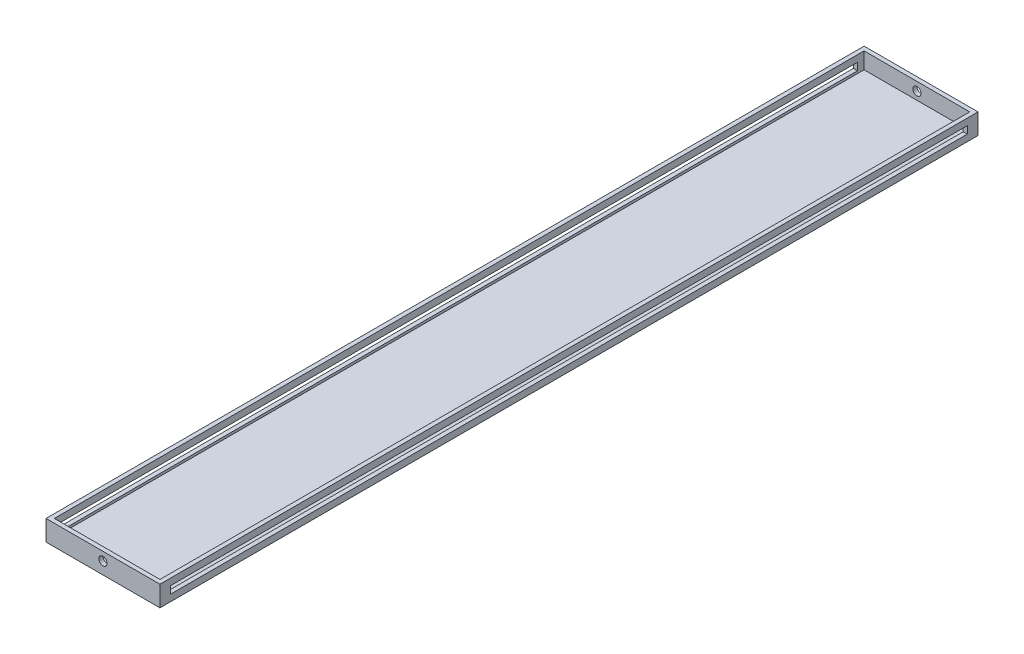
ISO-10303-21;
HEADER;
FILE_DESCRIPTION(('STEP AP214'),'2;1');
FILE_NAME('part.step','',(''),(''),'','','');
FILE_SCHEMA(('AUTOMOTIVE_DESIGN { 1 0 10303 214 1 1 1 1 }'));
ENDSEC;
DATA;
#1=APPLICATION_CONTEXT('core data for automotive mechanical design processes');
#2=APPLICATION_PROTOCOL_DEFINITION('international standard','automotive_design',2000,#1);
#3=PRODUCT_CONTEXT('',#1,'mechanical');
#4=PRODUCT('Part','Part','',(#3));
#5=PRODUCT_RELATED_PRODUCT_CATEGORY('part','',(#4));
#6=PRODUCT_DEFINITION_FORMATION('','',#4);
#7=PRODUCT_DEFINITION_CONTEXT('part definition',#1,'design');
#8=PRODUCT_DEFINITION('design','',#6,#7);
#9=PRODUCT_DEFINITION_SHAPE('','',#8);
#10=(LENGTH_UNIT() NAMED_UNIT(*) SI_UNIT(.MILLI.,.METRE.));
#11=(NAMED_UNIT(*) PLANE_ANGLE_UNIT() SI_UNIT($,.RADIAN.));
#12=(NAMED_UNIT(*) SI_UNIT($,.STERADIAN.) SOLID_ANGLE_UNIT());
#13=UNCERTAINTY_MEASURE_WITH_UNIT(LENGTH_MEASURE(1.E-05),#10,'distance_accuracy_value','');
#14=(GEOMETRIC_REPRESENTATION_CONTEXT(3) GLOBAL_UNCERTAINTY_ASSIGNED_CONTEXT((#13)) GLOBAL_UNIT_ASSIGNED_CONTEXT((#10,
#11,#12)) REPRESENTATION_CONTEXT('',''));
#15=CARTESIAN_POINT('',(0.,0.,0.));
#16=DIRECTION('',(0.,0.,1.));
#17=DIRECTION('',(1.,0.,0.));
#18=AXIS2_PLACEMENT_3D('',#15,#16,#17);
#19=CARTESIAN_POINT('',(0.,3.175,0.));
#20=DIRECTION('',(0.,0.,-1.));
#21=DIRECTION('',(-1.,0.,0.));
#22=AXIS2_PLACEMENT_3D('',#19,#20,#21);
#23=PLANE('',#22);
#24=DIRECTION('',(-0.00138718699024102,-0.999999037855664,0.));
#25=VECTOR('',#24,1.);
#26=CARTESIAN_POINT('',(0.,0.,0.));
#27=LINE('',#26,#25);
#28=CARTESIAN_POINT('',(0.00440432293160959,3.175,0.));
#29=VERTEX_POINT('',#28);
#30=CARTESIAN_POINT('',(0.,0.,0.));
#31=VERTEX_POINT('',#30);
#32=EDGE_CURVE('E11',#29,#31,#27,.T.);
#33=ORIENTED_EDGE('',*,*,#32,.F.);
#34=DIRECTION('',(1.,0.,0.));
#35=VECTOR('',#34,1.);
#36=CARTESIAN_POINT('',(0.,3.175,0.));
#37=LINE('',#36,#35);
#38=CARTESIAN_POINT('',(0.,3.175,0.));
#39=VERTEX_POINT('',#38);
#40=EDGE_CURVE('E334',#39,#29,#37,.T.);
#41=ORIENTED_EDGE('',*,*,#40,.F.);
#42=DIRECTION('',(0.,-1.,0.));
#43=VECTOR('',#42,1.);
#44=CARTESIAN_POINT('',(0.,3.175,0.));
#45=LINE('',#44,#43);
#46=EDGE_CURVE('E48',#39,#31,#45,.T.);
#47=ORIENTED_EDGE('',*,*,#46,.T.);
#48=EDGE_LOOP('',(#33,#41,#47));
#49=FACE_BOUND('',#48,.T.);
#50=ADVANCED_FACE('F39',(#49),#23,.F.);
#51=CARTESIAN_POINT('',(84.7309529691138,3.175,-624.731262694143));
#52=DIRECTION('',(0.,0.,1.));
#53=DIRECTION('',(1.,0.,0.));
#54=AXIS2_PLACEMENT_3D('',#51,#52,#53);
#55=PLANE('',#54);
#56=DIRECTION('',(0.00138718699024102,0.999999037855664,0.));
#57=VECTOR('',#56,1.);
#58=CARTESIAN_POINT('',(0.0219529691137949,15.8255146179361,-624.731262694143));
#59=LINE('',#58,#57);
#60=CARTESIAN_POINT('',(0.,0.,-624.731262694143));
#61=VERTEX_POINT('',#60);
#62=CARTESIAN_POINT('',(0.00440432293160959,3.175,-624.731262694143));
#63=VERTEX_POINT('',#62);
#64=EDGE_CURVE('E213',#61,#63,#59,.T.);
#65=ORIENTED_EDGE('',*,*,#64,.F.);
#66=DIRECTION('',(0.,-1.,0.));
#67=VECTOR('',#66,1.);
#68=CARTESIAN_POINT('',(0.,3.175,-624.731262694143));
#69=LINE('',#68,#67);
#70=CARTESIAN_POINT('',(0.,3.175,-624.731262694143));
#71=VERTEX_POINT('',#70);
#72=EDGE_CURVE('E343',#71,#61,#69,.T.);
#73=ORIENTED_EDGE('',*,*,#72,.F.);
#74=DIRECTION('',(-1.,0.,0.));
#75=VECTOR('',#74,1.);
#76=CARTESIAN_POINT('',(84.7309529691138,3.175,-624.731262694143));
#77=LINE('',#76,#75);
#78=EDGE_CURVE('E340',#63,#71,#77,.T.);
#79=ORIENTED_EDGE('',*,*,#78,.F.);
#80=EDGE_LOOP('',(#65,#73,#79));
#81=FACE_BOUND('',#80,.T.);
#82=ADVANCED_FACE('F406',(#81),#55,.F.);
#83=CARTESIAN_POINT('',(0.,3.175,0.));
#84=DIRECTION('',(0.,1.,0.));
#85=DIRECTION('',(0.,0.,1.));
#86=AXIS2_PLACEMENT_3D('',#83,#84,#85);
#87=PLANE('',#86);
#88=CARTESIAN_POINT('',(84.7309529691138,3.175,-624.731262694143));
#89=VERTEX_POINT('',#88);
#90=CARTESIAN_POINT('',(3.19695296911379,3.175,-624.731262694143));
#91=VERTEX_POINT('',#90);
#92=EDGE_CURVE('E341',#89,#91,#77,.T.);
#93=ORIENTED_EDGE('',*,*,#92,.T.);
#94=DIRECTION('',(0.,0.,1.));
#95=VECTOR('',#94,1.);
#96=CARTESIAN_POINT('',(3.19695296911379,3.175,0.));
#97=LINE('',#96,#95);
#98=CARTESIAN_POINT('',(3.19695296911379,3.175,0.));
#99=VERTEX_POINT('',#98);
#100=EDGE_CURVE('E285',#91,#99,#97,.T.);
#101=ORIENTED_EDGE('',*,*,#100,.T.);
#102=CARTESIAN_POINT('',(84.7309529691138,3.175,0.));
#103=VERTEX_POINT('',#102);
#104=EDGE_CURVE('E333',#99,#103,#37,.T.);
#105=ORIENTED_EDGE('',*,*,#104,.T.);
#106=DIRECTION('',(0.,0.,-1.));
#107=VECTOR('',#106,1.);
#108=CARTESIAN_POINT('',(84.7309529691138,3.175,0.));
#109=LINE('',#108,#107);
#110=EDGE_CURVE('E336',#103,#89,#109,.T.);
#111=ORIENTED_EDGE('',*,*,#110,.T.);
#112=EDGE_LOOP('',(#93,#101,#105,#111));
#113=FACE_BOUND('',#112,.T.);
#114=ADVANCED_FACE('F390',(#113),#87,.T.);
#115=CARTESIAN_POINT('',(0.,3.175,-624.731262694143));
#116=DIRECTION('',(1.,0.,0.));
#117=DIRECTION('',(0.,0.,-1.));
#118=AXIS2_PLACEMENT_3D('',#115,#116,#117);
#119=PLANE('',#118);
#120=DIRECTION('',(0.,0.,1.));
#121=VECTOR('',#120,1.);
#122=CARTESIAN_POINT('',(0.,0.,-624.731262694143));
#123=LINE('',#122,#121);
#124=EDGE_CURVE('E323',#61,#31,#123,.T.);
#125=ORIENTED_EDGE('',*,*,#124,.T.);
#126=ORIENTED_EDGE('',*,*,#46,.F.);
#127=DIRECTION('',(0.,0.,1.));
#128=VECTOR('',#127,1.);
#129=CARTESIAN_POINT('',(0.,3.175,-624.731262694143));
#130=LINE('',#129,#128);
#131=EDGE_CURVE('E330',#71,#39,#130,.T.);
#132=ORIENTED_EDGE('',*,*,#131,.F.);
#133=ORIENTED_EDGE('',*,*,#72,.T.);
#134=EDGE_LOOP('',(#125,#126,#132,#133));
#135=FACE_BOUND('',#134,.T.);
#136=ADVANCED_FACE('F41',(#135),#119,.F.);
#137=DIRECTION('',(0.,0.,1.));
#138=VECTOR('',#137,1.);
#139=CARTESIAN_POINT('',(0.0219529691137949,3.175,0.));
#140=LINE('',#139,#138);
#141=CARTESIAN_POINT('',(0.0219529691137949,3.175,-624.731262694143));
#142=VERTEX_POINT('',#141);
#143=CARTESIAN_POINT('',(0.0219529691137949,3.175,0.));
#144=VERTEX_POINT('',#143);
#145=EDGE_CURVE('E63',#142,#144,#140,.T.);
#146=ORIENTED_EDGE('',*,*,#145,.F.);
#147=EDGE_CURVE('E344',#142,#63,#77,.T.);
#148=ORIENTED_EDGE('',*,*,#147,.T.);
#149=ORIENTED_EDGE('',*,*,#78,.T.);
#150=ORIENTED_EDGE('',*,*,#131,.T.);
#151=ORIENTED_EDGE('',*,*,#40,.T.);
#152=EDGE_CURVE('E337',#29,#144,#37,.T.);
#153=ORIENTED_EDGE('',*,*,#152,.T.);
#154=EDGE_LOOP('',(#146,#148,#149,#150,#151,#153));
#155=FACE_BOUND('',#154,.T.);
#156=ADVANCED_FACE('F392',(#155),#87,.T.);
#157=CARTESIAN_POINT('',(0.,0.,0.));
#158=DIRECTION('',(0.,1.,0.));
#159=DIRECTION('',(0.,0.,1.));
#160=AXIS2_PLACEMENT_3D('',#157,#158,#159);
#161=PLANE('',#160);
#162=ORIENTED_EDGE('',*,*,#124,.F.);
#163=DIRECTION('',(0.,0.,1.));
#164=VECTOR('',#163,1.);
#165=CARTESIAN_POINT('',(0.,0.,-627.906262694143));
#166=LINE('',#165,#164);
#167=CARTESIAN_POINT('',(0.,0.,-627.906262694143));
#168=VERTEX_POINT('',#167);
#169=EDGE_CURVE('E235',#168,#61,#166,.T.);
#170=ORIENTED_EDGE('',*,*,#169,.F.);
#171=DIRECTION('',(-1.,0.,0.));
#172=VECTOR('',#171,1.);
#173=CARTESIAN_POINT('',(0.,0.,-627.906262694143));
#174=LINE('',#173,#172);
#175=CARTESIAN_POINT('',(87.9059529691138,0.,-627.906262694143));
#176=VERTEX_POINT('',#175);
#177=EDGE_CURVE('E221',#176,#168,#174,.T.);
#178=ORIENTED_EDGE('',*,*,#177,.F.);
#179=DIRECTION('',(0.,0.,-1.));
#180=VECTOR('',#179,1.);
#181=CARTESIAN_POINT('',(87.9059529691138,0.,-624.731262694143));
#182=LINE('',#181,#180);
#183=CARTESIAN_POINT('',(87.9059529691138,0.,3.175));
#184=VERTEX_POINT('',#183);
#185=EDGE_CURVE('E191',#184,#176,#182,.T.);
#186=ORIENTED_EDGE('',*,*,#185,.F.);
#187=DIRECTION('',(1.,0.,0.));
#188=VECTOR('',#187,1.);
#189=CARTESIAN_POINT('',(87.9059529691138,0.,3.175));
#190=LINE('',#189,#188);
#191=CARTESIAN_POINT('',(0.,0.,3.175));
#192=VERTEX_POINT('',#191);
#193=EDGE_CURVE('E184',#192,#184,#190,.T.);
#194=ORIENTED_EDGE('',*,*,#193,.F.);
#195=DIRECTION('',(0.,0.,-1.));
#196=VECTOR('',#195,1.);
#197=CARTESIAN_POINT('',(0.,0.,3.175));
#198=LINE('',#197,#196);
#199=EDGE_CURVE('E189',#192,#31,#198,.T.);
#200=ORIENTED_EDGE('',*,*,#199,.T.);
#201=EDGE_LOOP('',(#162,#170,#178,#186,#194,#200));
#202=FACE_BOUND('',#201,.T.);
#203=ADVANCED_FACE('F187',(#202),#161,.F.);
#204=CARTESIAN_POINT('',(84.7309529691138,0.,0.));
#205=DIRECTION('',(-1.,0.,0.));
#206=DIRECTION('',(0.,0.,1.));
#207=AXIS2_PLACEMENT_3D('',#204,#205,#206);
#208=PLANE('',#207);
#209=DIRECTION('',(0.,0.,1.));
#210=VECTOR('',#209,1.);
#211=CARTESIAN_POINT('',(84.7309529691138,10.7455146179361,-5.08));
#212=LINE('',#211,#210);
#213=CARTESIAN_POINT('',(84.7309529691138,10.7455146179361,-619.651262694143));
#214=VERTEX_POINT('',#213);
#215=CARTESIAN_POINT('',(84.7309529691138,10.7455146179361,-5.08));
#216=VERTEX_POINT('',#215);
#217=EDGE_CURVE('E291',#214,#216,#212,.T.);
#218=ORIENTED_EDGE('',*,*,#217,.T.);
#219=DIRECTION('',(0.,-1.,0.));
#220=VECTOR('',#219,1.);
#221=CARTESIAN_POINT('',(84.7309529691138,5.08,-5.08));
#222=LINE('',#221,#220);
#223=CARTESIAN_POINT('',(84.7309529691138,5.08,-5.08));
#224=VERTEX_POINT('',#223);
#225=EDGE_CURVE('E287',#216,#224,#222,.T.);
#226=ORIENTED_EDGE('',*,*,#225,.T.);
#227=DIRECTION('',(0.,0.,-1.));
#228=VECTOR('',#227,1.);
#229=CARTESIAN_POINT('',(84.7309529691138,5.08,-619.651262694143));
#230=LINE('',#229,#228);
#231=CARTESIAN_POINT('',(84.7309529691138,5.08,-619.651262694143));
#232=VERTEX_POINT('',#231);
#233=EDGE_CURVE('E301',#224,#232,#230,.T.);
#234=ORIENTED_EDGE('',*,*,#233,.T.);
#235=DIRECTION('',(0.,1.,0.));
#236=VECTOR('',#235,1.);
#237=CARTESIAN_POINT('',(84.7309529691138,10.7455146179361,-619.651262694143));
#238=LINE('',#237,#236);
#239=EDGE_CURVE('E304',#232,#214,#238,.T.);
#240=ORIENTED_EDGE('',*,*,#239,.T.);
#241=EDGE_LOOP('',(#218,#226,#234,#240));
#242=FACE_BOUND('',#241,.T.);
#243=ORIENTED_EDGE('',*,*,#110,.F.);
#244=DIRECTION('',(0.,-1.,0.));
#245=VECTOR('',#244,1.);
#246=CARTESIAN_POINT('',(84.7309529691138,3.175,0.));
#247=LINE('',#246,#245);
#248=CARTESIAN_POINT('',(84.7309529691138,15.8255146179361,0.));
#249=VERTEX_POINT('',#248);
#250=EDGE_CURVE('E321',#249,#103,#247,.T.);
#251=ORIENTED_EDGE('',*,*,#250,.F.);
#252=DIRECTION('',(0.,0.,1.));
#253=VECTOR('',#252,1.);
#254=CARTESIAN_POINT('',(84.7309529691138,15.8255146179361,0.));
#255=LINE('',#254,#253);
#256=CARTESIAN_POINT('',(84.7309529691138,15.8255146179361,-624.731262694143));
#257=VERTEX_POINT('',#256);
#258=EDGE_CURVE('E326',#257,#249,#255,.T.);
#259=ORIENTED_EDGE('',*,*,#258,.F.);
#260=DIRECTION('',(0.,1.,0.));
#261=VECTOR('',#260,1.);
#262=CARTESIAN_POINT('',(84.7309529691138,15.8255146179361,-624.731262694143));
#263=LINE('',#262,#261);
#264=EDGE_CURVE('E318',#89,#257,#263,.T.);
#265=ORIENTED_EDGE('',*,*,#264,.F.);
#266=EDGE_LOOP('',(#243,#251,#259,#265));
#267=FACE_BOUND('',#266,.T.);
#268=ADVANCED_FACE('F388',(#242,#267),#208,.T.);
#269=CARTESIAN_POINT('',(87.9059529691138,0.,0.));
#270=DIRECTION('',(-1.,0.,0.));
#271=DIRECTION('',(0.,0.,1.));
#272=AXIS2_PLACEMENT_3D('',#269,#270,#271);
#273=PLANE('',#272);
#274=DIRECTION('',(0.,0.,1.));
#275=VECTOR('',#274,1.);
#276=CARTESIAN_POINT('',(87.9059529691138,15.8255146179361,0.));
#277=LINE('',#276,#275);
#278=CARTESIAN_POINT('',(87.9059529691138,15.8255146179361,-627.906262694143));
#279=VERTEX_POINT('',#278);
#280=CARTESIAN_POINT('',(87.9059529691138,15.8255146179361,3.175));
#281=VERTEX_POINT('',#280);
#282=EDGE_CURVE('E320',#279,#281,#277,.T.);
#283=ORIENTED_EDGE('',*,*,#282,.T.);
#284=DIRECTION('',(0.,1.,0.));
#285=VECTOR('',#284,1.);
#286=CARTESIAN_POINT('',(87.9059529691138,15.8255146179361,3.175));
#287=LINE('',#286,#285);
#288=EDGE_CURVE('E195',#184,#281,#287,.T.);
#289=ORIENTED_EDGE('',*,*,#288,.F.);
#290=ORIENTED_EDGE('',*,*,#185,.T.);
#291=DIRECTION('',(0.,-1.,0.));
#292=VECTOR('',#291,1.);
#293=CARTESIAN_POINT('',(87.9059529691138,0.,-627.906262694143));
#294=LINE('',#293,#292);
#295=EDGE_CURVE('E218',#279,#176,#294,.T.);
#296=ORIENTED_EDGE('',*,*,#295,.F.);
#297=EDGE_LOOP('',(#283,#289,#290,#296));
#298=FACE_BOUND('',#297,.T.);
#299=DIRECTION('',(0.,-1.,0.));
#300=VECTOR('',#299,1.);
#301=CARTESIAN_POINT('',(87.9059529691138,5.08,-5.08));
#302=LINE('',#301,#300);
#303=CARTESIAN_POINT('',(87.9059529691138,10.7455146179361,-5.08));
#304=VERTEX_POINT('',#303);
#305=CARTESIAN_POINT('',(87.9059529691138,5.08,-5.08));
#306=VERTEX_POINT('',#305);
#307=EDGE_CURVE('E288',#304,#306,#302,.T.);
#308=ORIENTED_EDGE('',*,*,#307,.F.);
#309=DIRECTION('',(0.,0.,1.));
#310=VECTOR('',#309,1.);
#311=CARTESIAN_POINT('',(87.9059529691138,10.7455146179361,-5.08));
#312=LINE('',#311,#310);
#313=CARTESIAN_POINT('',(87.9059529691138,10.7455146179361,-619.651262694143));
#314=VERTEX_POINT('',#313);
#315=EDGE_CURVE('E296',#314,#304,#312,.T.);
#316=ORIENTED_EDGE('',*,*,#315,.F.);
#317=DIRECTION('',(0.,1.,0.));
#318=VECTOR('',#317,1.);
#319=CARTESIAN_POINT('',(87.9059529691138,10.7455146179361,-619.651262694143));
#320=LINE('',#319,#318);
#321=CARTESIAN_POINT('',(87.9059529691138,5.08,-619.651262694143));
#322=VERTEX_POINT('',#321);
#323=EDGE_CURVE('E293',#322,#314,#320,.T.);
#324=ORIENTED_EDGE('',*,*,#323,.F.);
#325=DIRECTION('',(0.,0.,-1.));
#326=VECTOR('',#325,1.);
#327=CARTESIAN_POINT('',(87.9059529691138,5.08,-619.651262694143));
#328=LINE('',#327,#326);
#329=EDGE_CURVE('E290',#306,#322,#328,.T.);
#330=ORIENTED_EDGE('',*,*,#329,.F.);
#331=EDGE_LOOP('',(#308,#316,#324,#330));
#332=FACE_BOUND('',#331,.T.);
#333=ADVANCED_FACE('F361',(#298,#332),#273,.F.);
#334=CARTESIAN_POINT('',(87.9059529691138,15.8255146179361,0.));
#335=DIRECTION('',(0.,-1.,0.));
#336=DIRECTION('',(0.,0.,-1.));
#337=AXIS2_PLACEMENT_3D('',#334,#335,#336);
#338=PLANE('',#337);
#339=ORIENTED_EDGE('',*,*,#258,.T.);
#340=DIRECTION('',(-1.,0.,0.));
#341=VECTOR('',#340,1.);
#342=CARTESIAN_POINT('',(0.0219529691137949,15.8255146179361,0.));
#343=LINE('',#342,#341);
#344=CARTESIAN_POINT('',(3.19695296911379,15.8255146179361,0.));
#345=VERTEX_POINT('',#344);
#346=EDGE_CURVE('E205',#249,#345,#343,.T.);
#347=ORIENTED_EDGE('',*,*,#346,.T.);
#348=DIRECTION('',(0.,0.,1.));
#349=VECTOR('',#348,1.);
#350=CARTESIAN_POINT('',(3.19695296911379,15.8255146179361,0.));
#351=LINE('',#350,#349);
#352=CARTESIAN_POINT('',(3.19695296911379,15.8255146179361,-624.731262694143));
#353=VERTEX_POINT('',#352);
#354=EDGE_CURVE('E276',#353,#345,#351,.T.);
#355=ORIENTED_EDGE('',*,*,#354,.F.);
#356=DIRECTION('',(1.,0.,0.));
#357=VECTOR('',#356,1.);
#358=CARTESIAN_POINT('',(87.9059529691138,15.8255146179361,-624.731262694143));
#359=LINE('',#358,#357);
#360=EDGE_CURVE('E222',#353,#257,#359,.T.);
#361=ORIENTED_EDGE('',*,*,#360,.T.);
#362=EDGE_LOOP('',(#339,#347,#355,#361));
#363=FACE_BOUND('',#362,.T.);
#364=DIRECTION('',(-1.,0.,0.));
#365=VECTOR('',#364,1.);
#366=CARTESIAN_POINT('',(0.0219529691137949,15.8255146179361,3.175));
#367=LINE('',#366,#365);
#368=CARTESIAN_POINT('',(0.0219529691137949,15.8255146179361,3.175));
#369=VERTEX_POINT('',#368);
#370=EDGE_CURVE('E201',#281,#369,#367,.T.);
#371=ORIENTED_EDGE('',*,*,#370,.F.);
#372=ORIENTED_EDGE('',*,*,#282,.F.);
#373=DIRECTION('',(1.,0.,0.));
#374=VECTOR('',#373,1.);
#375=CARTESIAN_POINT('',(87.9059529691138,15.8255146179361,-627.906262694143));
#376=LINE('',#375,#374);
#377=CARTESIAN_POINT('',(0.0219529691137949,15.8255146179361,-627.906262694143));
#378=VERTEX_POINT('',#377);
#379=EDGE_CURVE('E226',#378,#279,#376,.T.);
#380=ORIENTED_EDGE('',*,*,#379,.F.);
#381=DIRECTION('',(0.,0.,1.));
#382=VECTOR('',#381,1.);
#383=CARTESIAN_POINT('',(0.0219529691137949,15.8255146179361,-627.906262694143));
#384=LINE('',#383,#382);
#385=CARTESIAN_POINT('',(0.0219529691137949,15.8255146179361,-624.731262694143));
#386=VERTEX_POINT('',#385);
#387=EDGE_CURVE('E228',#378,#386,#384,.T.);
#388=ORIENTED_EDGE('',*,*,#387,.T.);
#389=DIRECTION('',(0.,0.,1.));
#390=VECTOR('',#389,1.);
#391=CARTESIAN_POINT('',(0.0219529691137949,15.8255146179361,0.));
#392=LINE('',#391,#390);
#393=CARTESIAN_POINT('',(0.0219529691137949,15.8255146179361,0.));
#394=VERTEX_POINT('',#393);
#395=EDGE_CURVE('E280',#386,#394,#392,.T.);
#396=ORIENTED_EDGE('',*,*,#395,.T.);
#397=DIRECTION('',(0.,0.,-1.));
#398=VECTOR('',#397,1.);
#399=CARTESIAN_POINT('',(0.0219529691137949,15.8255146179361,3.175));
#400=LINE('',#399,#398);
#401=EDGE_CURVE('E210',#369,#394,#400,.T.);
#402=ORIENTED_EDGE('',*,*,#401,.F.);
#403=EDGE_LOOP('',(#371,#372,#380,#388,#396,#402));
#404=FACE_BOUND('',#403,.T.);
#405=ADVANCED_FACE('F370',(#363,#404),#338,.F.);
#406=CARTESIAN_POINT('',(87.9059529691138,5.08,-5.08));
#407=DIRECTION('',(0.,0.,-1.));
#408=DIRECTION('',(-1.,0.,0.));
#409=AXIS2_PLACEMENT_3D('',#406,#407,#408);
#410=PLANE('',#409);
#411=ORIENTED_EDGE('',*,*,#225,.F.);
#412=DIRECTION('',(-1.,0.,0.));
#413=VECTOR('',#412,1.);
#414=CARTESIAN_POINT('',(87.9059529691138,10.7455146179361,-5.08));
#415=LINE('',#414,#413);
#416=EDGE_CURVE('E298',#304,#216,#415,.T.);
#417=ORIENTED_EDGE('',*,*,#416,.F.);
#418=ORIENTED_EDGE('',*,*,#307,.T.);
#419=DIRECTION('',(-1.,0.,0.));
#420=VECTOR('',#419,1.);
#421=CARTESIAN_POINT('',(87.9059529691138,5.08,-5.08));
#422=LINE('',#421,#420);
#423=EDGE_CURVE('E315',#306,#224,#422,.T.);
#424=ORIENTED_EDGE('',*,*,#423,.T.);
#425=EDGE_LOOP('',(#411,#417,#418,#424));
#426=FACE_BOUND('',#425,.T.);
#427=ADVANCED_FACE('F422',(#426),#410,.T.);
#428=CARTESIAN_POINT('',(87.9059529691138,5.08,-619.651262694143));
#429=DIRECTION('',(0.,1.,0.));
#430=DIRECTION('',(0.,0.,1.));
#431=AXIS2_PLACEMENT_3D('',#428,#429,#430);
#432=PLANE('',#431);
#433=ORIENTED_EDGE('',*,*,#233,.F.);
#434=ORIENTED_EDGE('',*,*,#423,.F.);
#435=ORIENTED_EDGE('',*,*,#329,.T.);
#436=DIRECTION('',(-1.,0.,0.));
#437=VECTOR('',#436,1.);
#438=CARTESIAN_POINT('',(87.9059529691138,5.08,-619.651262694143));
#439=LINE('',#438,#437);
#440=EDGE_CURVE('E313',#322,#232,#439,.T.);
#441=ORIENTED_EDGE('',*,*,#440,.T.);
#442=EDGE_LOOP('',(#433,#434,#435,#441));
#443=FACE_BOUND('',#442,.T.);
#444=ADVANCED_FACE('F430',(#443),#432,.T.);
#445=CARTESIAN_POINT('',(87.9059529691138,10.7455146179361,-619.651262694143));
#446=DIRECTION('',(0.,0.,1.));
#447=DIRECTION('',(1.,0.,0.));
#448=AXIS2_PLACEMENT_3D('',#445,#446,#447);
#449=PLANE('',#448);
#450=ORIENTED_EDGE('',*,*,#239,.F.);
#451=ORIENTED_EDGE('',*,*,#440,.F.);
#452=ORIENTED_EDGE('',*,*,#323,.T.);
#453=DIRECTION('',(-1.,0.,0.));
#454=VECTOR('',#453,1.);
#455=CARTESIAN_POINT('',(87.9059529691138,10.7455146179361,-619.651262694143));
#456=LINE('',#455,#454);
#457=EDGE_CURVE('E311',#314,#214,#456,.T.);
#458=ORIENTED_EDGE('',*,*,#457,.T.);
#459=EDGE_LOOP('',(#450,#451,#452,#458));
#460=FACE_BOUND('',#459,.T.);
#461=ADVANCED_FACE('F434',(#460),#449,.T.);
#462=CARTESIAN_POINT('',(87.9059529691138,10.7455146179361,-5.08));
#463=DIRECTION('',(0.,-1.,0.));
#464=DIRECTION('',(0.,0.,-1.));
#465=AXIS2_PLACEMENT_3D('',#462,#463,#464);
#466=PLANE('',#465);
#467=ORIENTED_EDGE('',*,*,#217,.F.);
#468=ORIENTED_EDGE('',*,*,#457,.F.);
#469=ORIENTED_EDGE('',*,*,#315,.T.);
#470=ORIENTED_EDGE('',*,*,#416,.T.);
#471=EDGE_LOOP('',(#467,#468,#469,#470));
#472=FACE_BOUND('',#471,.T.);
#473=ADVANCED_FACE('F438',(#472),#466,.T.);
#474=CARTESIAN_POINT('',(3.19695296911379,0.,0.));
#475=DIRECTION('',(-1.,0.,0.));
#476=DIRECTION('',(0.,0.,1.));
#477=AXIS2_PLACEMENT_3D('',#474,#475,#476);
#478=PLANE('',#477);
#479=ORIENTED_EDGE('',*,*,#100,.F.);
#480=DIRECTION('',(0.,1.,0.));
#481=VECTOR('',#480,1.);
#482=CARTESIAN_POINT('',(3.19695296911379,3.175,-624.731262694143));
#483=LINE('',#482,#481);
#484=EDGE_CURVE('E273',#91,#353,#483,.T.);
#485=ORIENTED_EDGE('',*,*,#484,.T.);
#486=ORIENTED_EDGE('',*,*,#354,.T.);
#487=DIRECTION('',(0.,-1.,0.));
#488=VECTOR('',#487,1.);
#489=CARTESIAN_POINT('',(3.19695296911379,0.,0.));
#490=LINE('',#489,#488);
#491=EDGE_CURVE('E270',#345,#99,#490,.T.);
#492=ORIENTED_EDGE('',*,*,#491,.T.);
#493=EDGE_LOOP('',(#479,#485,#486,#492));
#494=FACE_BOUND('',#493,.T.);
#495=DIRECTION('',(0.,-1.,0.));
#496=VECTOR('',#495,1.);
#497=CARTESIAN_POINT('',(3.19695296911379,5.08,-5.08));
#498=LINE('',#497,#496);
#499=CARTESIAN_POINT('',(3.19695296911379,10.7455146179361,-5.08));
#500=VERTEX_POINT('',#499);
#501=CARTESIAN_POINT('',(3.19695296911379,5.08,-5.08));
#502=VERTEX_POINT('',#501);
#503=EDGE_CURVE('E239',#500,#502,#498,.T.);
#504=ORIENTED_EDGE('',*,*,#503,.F.);
#505=DIRECTION('',(0.,0.,1.));
#506=VECTOR('',#505,1.);
#507=CARTESIAN_POINT('',(3.19695296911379,10.7455146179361,-5.08));
#508=LINE('',#507,#506);
#509=CARTESIAN_POINT('',(3.19695296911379,10.7455146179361,-619.651262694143));
#510=VERTEX_POINT('',#509);
#511=EDGE_CURVE('E247',#510,#500,#508,.T.);
#512=ORIENTED_EDGE('',*,*,#511,.F.);
#513=DIRECTION('',(0.,1.,0.));
#514=VECTOR('',#513,1.);
#515=CARTESIAN_POINT('',(3.19695296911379,10.7455146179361,-619.651262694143));
#516=LINE('',#515,#514);
#517=CARTESIAN_POINT('',(3.19695296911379,5.08,-619.651262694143));
#518=VERTEX_POINT('',#517);
#519=EDGE_CURVE('E244',#518,#510,#516,.T.);
#520=ORIENTED_EDGE('',*,*,#519,.F.);
#521=DIRECTION('',(0.,0.,-1.));
#522=VECTOR('',#521,1.);
#523=CARTESIAN_POINT('',(3.19695296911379,5.08,-619.651262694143));
#524=LINE('',#523,#522);
#525=EDGE_CURVE('E241',#502,#518,#524,.T.);
#526=ORIENTED_EDGE('',*,*,#525,.F.);
#527=EDGE_LOOP('',(#504,#512,#520,#526));
#528=FACE_BOUND('',#527,.T.);
#529=ADVANCED_FACE('F380',(#494,#528),#478,.F.);
#530=CARTESIAN_POINT('',(0.0219529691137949,0.,0.));
#531=DIRECTION('',(-1.,0.,0.));
#532=DIRECTION('',(0.,0.,1.));
#533=AXIS2_PLACEMENT_3D('',#530,#531,#532);
#534=PLANE('',#533);
#535=DIRECTION('',(0.,1.,0.));
#536=VECTOR('',#535,1.);
#537=CARTESIAN_POINT('',(0.0219529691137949,15.8255146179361,-624.731262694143));
#538=LINE('',#537,#536);
#539=EDGE_CURVE('E269',#142,#386,#538,.T.);
#540=ORIENTED_EDGE('',*,*,#539,.F.);
#541=ORIENTED_EDGE('',*,*,#145,.T.);
#542=DIRECTION('',(0.,-1.,0.));
#543=VECTOR('',#542,1.);
#544=CARTESIAN_POINT('',(0.0219529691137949,3.175,0.));
#545=LINE('',#544,#543);
#546=EDGE_CURVE('E274',#394,#144,#545,.T.);
#547=ORIENTED_EDGE('',*,*,#546,.F.);
#548=ORIENTED_EDGE('',*,*,#395,.F.);
#549=EDGE_LOOP('',(#540,#541,#547,#548));
#550=FACE_BOUND('',#549,.T.);
#551=DIRECTION('',(0.,0.,1.));
#552=VECTOR('',#551,1.);
#553=CARTESIAN_POINT('',(0.0219529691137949,10.7455146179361,-5.08));
#554=LINE('',#553,#552);
#555=CARTESIAN_POINT('',(0.0219529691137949,10.7455146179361,-619.651262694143));
#556=VERTEX_POINT('',#555);
#557=CARTESIAN_POINT('',(0.0219529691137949,10.7455146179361,-5.08));
#558=VERTEX_POINT('',#557);
#559=EDGE_CURVE('E242',#556,#558,#554,.T.);
#560=ORIENTED_EDGE('',*,*,#559,.T.);
#561=DIRECTION('',(0.,-1.,0.));
#562=VECTOR('',#561,1.);
#563=CARTESIAN_POINT('',(0.0219529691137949,5.08,-5.08));
#564=LINE('',#563,#562);
#565=CARTESIAN_POINT('',(0.0219529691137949,5.08,-5.08));
#566=VERTEX_POINT('',#565);
#567=EDGE_CURVE('E238',#558,#566,#564,.T.);
#568=ORIENTED_EDGE('',*,*,#567,.T.);
#569=DIRECTION('',(0.,0.,-1.));
#570=VECTOR('',#569,1.);
#571=CARTESIAN_POINT('',(0.0219529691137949,5.08,-619.651262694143));
#572=LINE('',#571,#570);
#573=CARTESIAN_POINT('',(0.0219529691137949,5.08,-619.651262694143));
#574=VERTEX_POINT('',#573);
#575=EDGE_CURVE('E252',#566,#574,#572,.T.);
#576=ORIENTED_EDGE('',*,*,#575,.T.);
#577=DIRECTION('',(0.,1.,0.));
#578=VECTOR('',#577,1.);
#579=CARTESIAN_POINT('',(0.0219529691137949,10.7455146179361,-619.651262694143));
#580=LINE('',#579,#578);
#581=EDGE_CURVE('E255',#574,#556,#580,.T.);
#582=ORIENTED_EDGE('',*,*,#581,.T.);
#583=EDGE_LOOP('',(#560,#568,#576,#582));
#584=FACE_BOUND('',#583,.T.);
#585=ADVANCED_FACE('F397',(#550,#584),#534,.T.);
#586=CARTESIAN_POINT('',(3.19695296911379,5.08,-5.08));
#587=DIRECTION('',(0.,0.,-1.));
#588=DIRECTION('',(-1.,0.,0.));
#589=AXIS2_PLACEMENT_3D('',#586,#587,#588);
#590=PLANE('',#589);
#591=ORIENTED_EDGE('',*,*,#567,.F.);
#592=DIRECTION('',(-1.,0.,0.));
#593=VECTOR('',#592,1.);
#594=CARTESIAN_POINT('',(3.19695296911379,10.7455146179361,-5.08));
#595=LINE('',#594,#593);
#596=EDGE_CURVE('E249',#500,#558,#595,.T.);
#597=ORIENTED_EDGE('',*,*,#596,.F.);
#598=ORIENTED_EDGE('',*,*,#503,.T.);
#599=DIRECTION('',(-1.,0.,0.));
#600=VECTOR('',#599,1.);
#601=CARTESIAN_POINT('',(3.19695296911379,5.08,-5.08));
#602=LINE('',#601,#600);
#603=EDGE_CURVE('E266',#502,#566,#602,.T.);
#604=ORIENTED_EDGE('',*,*,#603,.T.);
#605=EDGE_LOOP('',(#591,#597,#598,#604));
#606=FACE_BOUND('',#605,.T.);
#607=ADVANCED_FACE('F445',(#606),#590,.T.);
#608=CARTESIAN_POINT('',(3.19695296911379,5.08,-619.651262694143));
#609=DIRECTION('',(0.,1.,0.));
#610=DIRECTION('',(0.,0.,1.));
#611=AXIS2_PLACEMENT_3D('',#608,#609,#610);
#612=PLANE('',#611);
#613=ORIENTED_EDGE('',*,*,#575,.F.);
#614=ORIENTED_EDGE('',*,*,#603,.F.);
#615=ORIENTED_EDGE('',*,*,#525,.T.);
#616=DIRECTION('',(-1.,0.,0.));
#617=VECTOR('',#616,1.);
#618=CARTESIAN_POINT('',(3.19695296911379,5.08,-619.651262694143));
#619=LINE('',#618,#617);
#620=EDGE_CURVE('E264',#518,#574,#619,.T.);
#621=ORIENTED_EDGE('',*,*,#620,.T.);
#622=EDGE_LOOP('',(#613,#614,#615,#621));
#623=FACE_BOUND('',#622,.T.);
#624=ADVANCED_FACE('F450',(#623),#612,.T.);
#625=CARTESIAN_POINT('',(3.19695296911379,10.7455146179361,-619.651262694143));
#626=DIRECTION('',(0.,0.,1.));
#627=DIRECTION('',(1.,0.,0.));
#628=AXIS2_PLACEMENT_3D('',#625,#626,#627);
#629=PLANE('',#628);
#630=ORIENTED_EDGE('',*,*,#581,.F.);
#631=ORIENTED_EDGE('',*,*,#620,.F.);
#632=ORIENTED_EDGE('',*,*,#519,.T.);
#633=DIRECTION('',(-1.,0.,0.));
#634=VECTOR('',#633,1.);
#635=CARTESIAN_POINT('',(3.19695296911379,10.7455146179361,-619.651262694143));
#636=LINE('',#635,#634);
#637=EDGE_CURVE('E262',#510,#556,#636,.T.);
#638=ORIENTED_EDGE('',*,*,#637,.T.);
#639=EDGE_LOOP('',(#630,#631,#632,#638));
#640=FACE_BOUND('',#639,.T.);
#641=ADVANCED_FACE('F454',(#640),#629,.T.);
#642=CARTESIAN_POINT('',(3.19695296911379,10.7455146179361,-5.08));
#643=DIRECTION('',(0.,-1.,0.));
#644=DIRECTION('',(0.,0.,-1.));
#645=AXIS2_PLACEMENT_3D('',#642,#643,#644);
#646=PLANE('',#645);
#647=ORIENTED_EDGE('',*,*,#559,.F.);
#648=ORIENTED_EDGE('',*,*,#637,.F.);
#649=ORIENTED_EDGE('',*,*,#511,.T.);
#650=ORIENTED_EDGE('',*,*,#596,.T.);
#651=EDGE_LOOP('',(#647,#648,#649,#650));
#652=FACE_BOUND('',#651,.T.);
#653=ADVANCED_FACE('F458',(#652),#646,.T.);
#654=CARTESIAN_POINT('',(0.,0.,-624.731262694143));
#655=DIRECTION('',(0.,0.,1.));
#656=DIRECTION('',(1.,0.,0.));
#657=AXIS2_PLACEMENT_3D('',#654,#655,#656);
#658=PLANE('',#657);
#659=ORIENTED_EDGE('',*,*,#147,.F.);
#660=ORIENTED_EDGE('',*,*,#539,.T.);
#661=EDGE_CURVE('E209',#63,#386,#59,.T.);
#662=ORIENTED_EDGE('',*,*,#661,.F.);
#663=EDGE_LOOP('',(#659,#660,#662));
#664=FACE_BOUND('',#663,.T.);
#665=ADVANCED_FACE('F403',(#664),#658,.T.);
#666=CARTESIAN_POINT('',(43.9639529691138,9.32592913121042,-624.731262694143));
#667=DIRECTION('',(0.,0.,1.));
#668=DIRECTION('',(1.,0.,0.));
#669=AXIS2_PLACEMENT_3D('',#666,#667,#668);
#670=CIRCLE('',#669,3.175);
#671=CARTESIAN_POINT('',(47.1389529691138,9.32592913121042,-624.731262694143));
#672=VERTEX_POINT('',#671);
#673=EDGE_CURVE('E365',#672,#672,#670,.T.);
#674=ORIENTED_EDGE('',*,*,#673,.F.);
#675=EDGE_LOOP('',(#674));
#676=FACE_BOUND('',#675,.T.);
#677=ORIENTED_EDGE('',*,*,#484,.F.);
#678=ORIENTED_EDGE('',*,*,#92,.F.);
#679=ORIENTED_EDGE('',*,*,#264,.T.);
#680=ORIENTED_EDGE('',*,*,#360,.F.);
#681=EDGE_LOOP('',(#677,#678,#679,#680));
#682=FACE_BOUND('',#681,.T.);
#683=ADVANCED_FACE('F385',(#676,#682),#658,.T.);
#684=CARTESIAN_POINT('',(0.0219529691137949,15.8255146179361,-627.906262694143));
#685=DIRECTION('',(0.999999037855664,-0.00138718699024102,0.));
#686=DIRECTION('',(0.00138718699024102,0.999999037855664,0.));
#687=AXIS2_PLACEMENT_3D('',#684,#685,#686);
#688=PLANE('',#687);
#689=ORIENTED_EDGE('',*,*,#64,.T.);
#690=ORIENTED_EDGE('',*,*,#661,.T.);
#691=ORIENTED_EDGE('',*,*,#387,.F.);
#692=DIRECTION('',(0.00138718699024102,0.999999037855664,0.));
#693=VECTOR('',#692,1.);
#694=CARTESIAN_POINT('',(0.0219529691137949,15.8255146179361,-627.906262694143));
#695=LINE('',#694,#693);
#696=EDGE_CURVE('E224',#168,#378,#695,.T.);
#697=ORIENTED_EDGE('',*,*,#696,.F.);
#698=ORIENTED_EDGE('',*,*,#169,.T.);
#699=EDGE_LOOP('',(#689,#690,#691,#697,#698));
#700=FACE_BOUND('',#699,.T.);
#701=ADVANCED_FACE('F354',(#700),#688,.F.);
#702=CARTESIAN_POINT('',(0.,0.,-627.906262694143));
#703=DIRECTION('',(0.,0.,1.));
#704=DIRECTION('',(1.,0.,0.));
#705=AXIS2_PLACEMENT_3D('',#702,#703,#704);
#706=PLANE('',#705);
#707=CARTESIAN_POINT('',(43.9639529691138,9.32592913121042,-627.906262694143));
#708=DIRECTION('',(0.,0.,1.));
#709=DIRECTION('',(1.,0.,0.));
#710=AXIS2_PLACEMENT_3D('',#707,#708,#709);
#711=CIRCLE('',#710,3.175);
#712=CARTESIAN_POINT('',(47.1389529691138,9.32592913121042,-627.906262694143));
#713=VERTEX_POINT('',#712);
#714=EDGE_CURVE('E489',#713,#713,#711,.T.);
#715=ORIENTED_EDGE('',*,*,#714,.T.);
#716=EDGE_LOOP('',(#715));
#717=FACE_BOUND('',#716,.T.);
#718=ORIENTED_EDGE('',*,*,#295,.T.);
#719=ORIENTED_EDGE('',*,*,#177,.T.);
#720=ORIENTED_EDGE('',*,*,#696,.T.);
#721=ORIENTED_EDGE('',*,*,#379,.T.);
#722=EDGE_LOOP('',(#718,#719,#720,#721));
#723=FACE_BOUND('',#722,.T.);
#724=ADVANCED_FACE('F358',(#717,#723),#706,.F.);
#725=CARTESIAN_POINT('',(0.,0.,0.));
#726=DIRECTION('',(0.,0.,-1.));
#727=DIRECTION('',(-1.,0.,0.));
#728=AXIS2_PLACEMENT_3D('',#725,#726,#727);
#729=PLANE('',#728);
#730=CARTESIAN_POINT('',(43.9639529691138,9.32592913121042,0.));
#731=DIRECTION('',(0.,0.,-1.));
#732=DIRECTION('',(-1.,0.,0.));
#733=AXIS2_PLACEMENT_3D('',#730,#731,#732);
#734=CIRCLE('',#733,3.175);
#735=CARTESIAN_POINT('',(40.7889529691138,9.32592913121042,0.));
#736=VERTEX_POINT('',#735);
#737=EDGE_CURVE('E492',#736,#736,#734,.T.);
#738=ORIENTED_EDGE('',*,*,#737,.F.);
#739=EDGE_LOOP('',(#738));
#740=FACE_BOUND('',#739,.T.);
#741=ORIENTED_EDGE('',*,*,#346,.F.);
#742=ORIENTED_EDGE('',*,*,#250,.T.);
#743=ORIENTED_EDGE('',*,*,#104,.F.);
#744=ORIENTED_EDGE('',*,*,#491,.F.);
#745=EDGE_LOOP('',(#741,#742,#743,#744));
#746=FACE_BOUND('',#745,.T.);
#747=ADVANCED_FACE('F376',(#740,#746),#729,.T.);
#748=CARTESIAN_POINT('',(0.,0.,3.175));
#749=DIRECTION('',(0.999999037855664,-0.00138718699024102,0.));
#750=DIRECTION('',(0.00138718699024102,0.999999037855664,0.));
#751=AXIS2_PLACEMENT_3D('',#748,#749,#750);
#752=PLANE('',#751);
#753=EDGE_CURVE('E50',#394,#29,#27,.T.);
#754=ORIENTED_EDGE('',*,*,#753,.T.);
#755=ORIENTED_EDGE('',*,*,#32,.T.);
#756=ORIENTED_EDGE('',*,*,#199,.F.);
#757=DIRECTION('',(-0.00138718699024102,-0.999999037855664,0.));
#758=VECTOR('',#757,1.);
#759=CARTESIAN_POINT('',(0.,0.,3.175));
#760=LINE('',#759,#758);
#761=EDGE_CURVE('E196',#369,#192,#760,.T.);
#762=ORIENTED_EDGE('',*,*,#761,.F.);
#763=ORIENTED_EDGE('',*,*,#401,.T.);
#764=EDGE_LOOP('',(#754,#755,#756,#762,#763));
#765=FACE_BOUND('',#764,.T.);
#766=ADVANCED_FACE('F208',(#765),#752,.F.);
#767=CARTESIAN_POINT('',(0.,0.,3.175));
#768=DIRECTION('',(0.,0.,-1.));
#769=DIRECTION('',(-1.,0.,0.));
#770=AXIS2_PLACEMENT_3D('',#767,#768,#769);
#771=PLANE('',#770);
#772=CARTESIAN_POINT('',(43.9639529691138,9.32592913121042,3.17500000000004));
#773=DIRECTION('',(0.,0.,-1.));
#774=DIRECTION('',(-1.,0.,0.));
#775=AXIS2_PLACEMENT_3D('',#772,#773,#774);
#776=CIRCLE('',#775,3.175);
#777=CARTESIAN_POINT('',(40.7889529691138,9.32592913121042,3.17500000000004));
#778=VERTEX_POINT('',#777);
#779=EDGE_CURVE('E43',#778,#778,#776,.T.);
#780=ORIENTED_EDGE('',*,*,#779,.T.);
#781=EDGE_LOOP('',(#780));
#782=FACE_BOUND('',#781,.T.);
#783=ORIENTED_EDGE('',*,*,#761,.T.);
#784=ORIENTED_EDGE('',*,*,#193,.T.);
#785=ORIENTED_EDGE('',*,*,#288,.T.);
#786=ORIENTED_EDGE('',*,*,#370,.T.);
#787=EDGE_LOOP('',(#783,#784,#785,#786));
#788=FACE_BOUND('',#787,.T.);
#789=ADVANCED_FACE('F199',(#782,#788),#771,.F.);
#790=ORIENTED_EDGE('',*,*,#753,.F.);
#791=ORIENTED_EDGE('',*,*,#546,.T.);
#792=ORIENTED_EDGE('',*,*,#152,.F.);
#793=EDGE_LOOP('',(#790,#791,#792));
#794=FACE_BOUND('',#793,.T.);
#795=ADVANCED_FACE('F400',(#794),#729,.T.);
#796=CARTESIAN_POINT('',(43.9639529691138,9.32592913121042,-627.906262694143));
#797=DIRECTION('',(0.,0.,1.));
#798=DIRECTION('',(1.,0.,0.));
#799=AXIS2_PLACEMENT_3D('',#796,#797,#798);
#800=CYLINDRICAL_SURFACE('',#799,3.175);
#801=ORIENTED_EDGE('',*,*,#737,.T.);
#802=EDGE_LOOP('',(#801));
#803=FACE_BOUND('',#802,.T.);
#804=ORIENTED_EDGE('',*,*,#779,.F.);
#805=EDGE_LOOP('',(#804));
#806=FACE_BOUND('',#805,.T.);
#807=ADVANCED_FACE('F473',(#803,#806),#800,.F.);
#808=ORIENTED_EDGE('',*,*,#673,.T.);
#809=EDGE_LOOP('',(#808));
#810=FACE_BOUND('',#809,.T.);
#811=ORIENTED_EDGE('',*,*,#714,.F.);
#812=EDGE_LOOP('',(#811));
#813=FACE_BOUND('',#812,.T.);
#814=ADVANCED_FACE('F477',(#810,#813),#800,.F.);
#815=CLOSED_SHELL('',(#50,#82,#114,#136,#156,#203,#268,#333,#405,#427,#444,#461,#473,#529,#585,
#607,#624,#641,#653,#665,#683,#701,#724,#747,#766,#789,#795,#807,#814));
#816=MANIFOLD_SOLID_BREP('B2',#815);
#817=ADVANCED_BREP_SHAPE_REPRESENTATION('',(#18,#816),#14);
#818=SHAPE_DEFINITION_REPRESENTATION(#9,#817);
ENDSEC;
END-ISO-10303-21;
